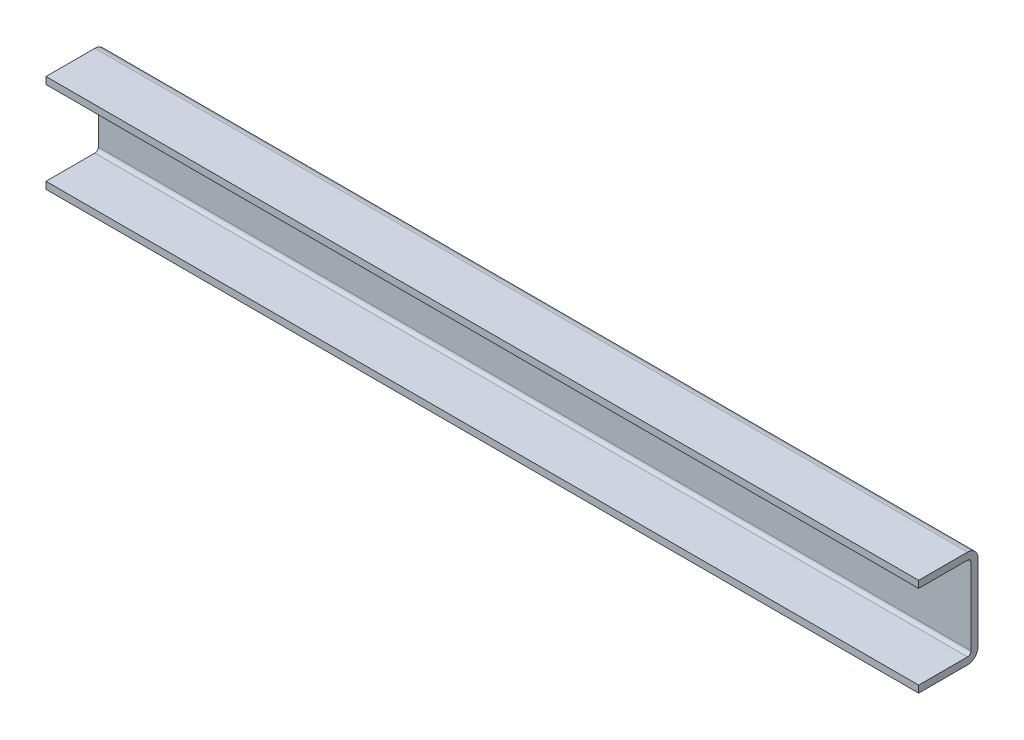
ISO-10303-21;
HEADER;
FILE_DESCRIPTION(('STEP AP214'),'2;1');
FILE_NAME('part.step','',(''),(''),'','','');
FILE_SCHEMA(('AUTOMOTIVE_DESIGN { 1 0 10303 214 1 1 1 1 }'));
ENDSEC;
DATA;
#1=APPLICATION_CONTEXT('core data for automotive mechanical design processes');
#2=APPLICATION_PROTOCOL_DEFINITION('international standard','automotive_design',2000,#1);
#3=PRODUCT_CONTEXT('',#1,'mechanical');
#4=PRODUCT('Part','Part','',(#3));
#5=PRODUCT_RELATED_PRODUCT_CATEGORY('part','',(#4));
#6=PRODUCT_DEFINITION_FORMATION('','',#4);
#7=PRODUCT_DEFINITION_CONTEXT('part definition',#1,'design');
#8=PRODUCT_DEFINITION('design','',#6,#7);
#9=PRODUCT_DEFINITION_SHAPE('','',#8);
#10=(LENGTH_UNIT() NAMED_UNIT(*) SI_UNIT(.MILLI.,.METRE.));
#11=(NAMED_UNIT(*) PLANE_ANGLE_UNIT() SI_UNIT($,.RADIAN.));
#12=(NAMED_UNIT(*) SI_UNIT($,.STERADIAN.) SOLID_ANGLE_UNIT());
#13=UNCERTAINTY_MEASURE_WITH_UNIT(LENGTH_MEASURE(1.E-05),#10,'distance_accuracy_value','');
#14=(GEOMETRIC_REPRESENTATION_CONTEXT(3) GLOBAL_UNCERTAINTY_ASSIGNED_CONTEXT((#13)) GLOBAL_UNIT_ASSIGNED_CONTEXT((#10,
#11,#12)) REPRESENTATION_CONTEXT('',''));
#15=CARTESIAN_POINT('',(0.,0.,0.));
#16=DIRECTION('',(0.,0.,1.));
#17=DIRECTION('',(1.,0.,0.));
#18=AXIS2_PLACEMENT_3D('',#15,#16,#17);
#19=CARTESIAN_POINT('',(-312.5,35.,-35.));
#20=DIRECTION('',(0.,1.,0.));
#21=DIRECTION('',(0.,0.,1.));
#22=AXIS2_PLACEMENT_3D('',#19,#20,#21);
#23=PLANE('',#22);
#24=DIRECTION('',(0.,0.,1.));
#25=VECTOR('',#24,1.);
#26=CARTESIAN_POINT('',(312.5,35.,-35.));
#27=LINE('',#26,#25);
#28=CARTESIAN_POINT('',(312.5,35.,-35.));
#29=VERTEX_POINT('',#28);
#30=CARTESIAN_POINT('',(312.5,35.,0.));
#31=VERTEX_POINT('',#30);
#32=EDGE_CURVE('E156',#29,#31,#27,.T.);
#33=ORIENTED_EDGE('',*,*,#32,.F.);
#34=DIRECTION('',(1.,0.,0.));
#35=VECTOR('',#34,1.);
#36=CARTESIAN_POINT('',(-312.5,35.,-35.));
#37=LINE('',#36,#35);
#38=CARTESIAN_POINT('',(-312.5,35.,-35.));
#39=VERTEX_POINT('',#38);
#40=EDGE_CURVE('E11',#39,#29,#37,.T.);
#41=ORIENTED_EDGE('',*,*,#40,.F.);
#42=DIRECTION('',(0.,0.,1.));
#43=VECTOR('',#42,1.);
#44=CARTESIAN_POINT('',(-312.5,35.,-35.));
#45=LINE('',#44,#43);
#46=CARTESIAN_POINT('',(-312.5,35.,0.));
#47=VERTEX_POINT('',#46);
#48=EDGE_CURVE('E188',#39,#47,#45,.T.);
#49=ORIENTED_EDGE('',*,*,#48,.T.);
#50=DIRECTION('',(1.,0.,0.));
#51=VECTOR('',#50,1.);
#52=CARTESIAN_POINT('',(-312.5,35.,0.));
#53=LINE('',#52,#51);
#54=EDGE_CURVE('E38',#47,#31,#53,.T.);
#55=ORIENTED_EDGE('',*,*,#54,.T.);
#56=EDGE_LOOP('',(#33,#41,#49,#55));
#57=FACE_BOUND('',#56,.T.);
#58=ADVANCED_FACE('F35',(#57),#23,.T.);
#59=CARTESIAN_POINT('',(-312.5,27.5,-35.));
#60=DIRECTION('',(1.,0.,0.));
#61=DIRECTION('',(0.,0.,-1.));
#62=AXIS2_PLACEMENT_3D('',#59,#60,#61);
#63=CYLINDRICAL_SURFACE('',#62,7.5);
#64=CARTESIAN_POINT('',(312.5,27.5,-35.));
#65=DIRECTION('',(1.,0.,0.));
#66=DIRECTION('',(0.,0.,-1.));
#67=AXIS2_PLACEMENT_3D('',#64,#65,#66);
#68=CIRCLE('',#67,7.5);
#69=CARTESIAN_POINT('',(312.5,27.5,-42.5));
#70=VERTEX_POINT('',#69);
#71=EDGE_CURVE('E186',#70,#29,#68,.T.);
#72=ORIENTED_EDGE('',*,*,#71,.F.);
#73=DIRECTION('',(1.,0.,0.));
#74=VECTOR('',#73,1.);
#75=CARTESIAN_POINT('',(-312.5,27.5,-42.5));
#76=LINE('',#75,#74);
#77=CARTESIAN_POINT('',(-312.5,27.5,-42.5));
#78=VERTEX_POINT('',#77);
#79=EDGE_CURVE('E44',#78,#70,#76,.T.);
#80=ORIENTED_EDGE('',*,*,#79,.F.);
#81=CARTESIAN_POINT('',(-312.5,27.5,-35.));
#82=DIRECTION('',(1.,0.,0.));
#83=DIRECTION('',(0.,0.,-1.));
#84=AXIS2_PLACEMENT_3D('',#81,#82,#83);
#85=CIRCLE('',#84,7.5);
#86=EDGE_CURVE('E146',#78,#39,#85,.T.);
#87=ORIENTED_EDGE('',*,*,#86,.T.);
#88=ORIENTED_EDGE('',*,*,#40,.T.);
#89=EDGE_LOOP('',(#72,#80,#87,#88));
#90=FACE_BOUND('',#89,.T.);
#91=ADVANCED_FACE('F208',(#90),#63,.T.);
#92=CARTESIAN_POINT('',(-312.5,-27.5,-42.5));
#93=DIRECTION('',(0.,0.,-1.));
#94=DIRECTION('',(-1.,0.,0.));
#95=AXIS2_PLACEMENT_3D('',#92,#93,#94);
#96=PLANE('',#95);
#97=DIRECTION('',(0.,1.,0.));
#98=VECTOR('',#97,1.);
#99=CARTESIAN_POINT('',(312.5,-27.5,-42.5));
#100=LINE('',#99,#98);
#101=CARTESIAN_POINT('',(312.5,-27.5,-42.5));
#102=VERTEX_POINT('',#101);
#103=EDGE_CURVE('E133',#102,#70,#100,.T.);
#104=ORIENTED_EDGE('',*,*,#103,.F.);
#105=DIRECTION('',(1.,0.,0.));
#106=VECTOR('',#105,1.);
#107=CARTESIAN_POINT('',(-312.5,-27.5,-42.5));
#108=LINE('',#107,#106);
#109=CARTESIAN_POINT('',(-312.5,-27.5,-42.5));
#110=VERTEX_POINT('',#109);
#111=EDGE_CURVE('E128',#110,#102,#108,.T.);
#112=ORIENTED_EDGE('',*,*,#111,.F.);
#113=DIRECTION('',(0.,1.,0.));
#114=VECTOR('',#113,1.);
#115=CARTESIAN_POINT('',(-312.5,-27.5,-42.5));
#116=LINE('',#115,#114);
#117=EDGE_CURVE('E131',#110,#78,#116,.T.);
#118=ORIENTED_EDGE('',*,*,#117,.T.);
#119=ORIENTED_EDGE('',*,*,#79,.T.);
#120=EDGE_LOOP('',(#104,#112,#118,#119));
#121=FACE_BOUND('',#120,.T.);
#122=ADVANCED_FACE('F130',(#121),#96,.T.);
#123=CARTESIAN_POINT('',(-312.5,-27.5,-35.));
#124=DIRECTION('',(1.,0.,0.));
#125=DIRECTION('',(0.,0.,-1.));
#126=AXIS2_PLACEMENT_3D('',#123,#124,#125);
#127=CYLINDRICAL_SURFACE('',#126,7.5);
#128=CARTESIAN_POINT('',(312.5,-27.5,-35.));
#129=DIRECTION('',(1.,0.,0.));
#130=DIRECTION('',(0.,0.,-1.));
#131=AXIS2_PLACEMENT_3D('',#128,#129,#130);
#132=CIRCLE('',#131,7.5);
#133=CARTESIAN_POINT('',(312.5,-35.,-35.));
#134=VERTEX_POINT('',#133);
#135=EDGE_CURVE('E183',#134,#102,#132,.T.);
#136=ORIENTED_EDGE('',*,*,#135,.F.);
#137=DIRECTION('',(1.,0.,0.));
#138=VECTOR('',#137,1.);
#139=CARTESIAN_POINT('',(-312.5,-35.,-35.));
#140=LINE('',#139,#138);
#141=CARTESIAN_POINT('',(-312.5,-35.,-35.));
#142=VERTEX_POINT('',#141);
#143=EDGE_CURVE('E138',#142,#134,#140,.T.);
#144=ORIENTED_EDGE('',*,*,#143,.F.);
#145=CARTESIAN_POINT('',(-312.5,-27.5,-35.));
#146=DIRECTION('',(1.,0.,0.));
#147=DIRECTION('',(0.,0.,-1.));
#148=AXIS2_PLACEMENT_3D('',#145,#146,#147);
#149=CIRCLE('',#148,7.5);
#150=EDGE_CURVE('E144',#142,#110,#149,.T.);
#151=ORIENTED_EDGE('',*,*,#150,.T.);
#152=ORIENTED_EDGE('',*,*,#111,.T.);
#153=EDGE_LOOP('',(#136,#144,#151,#152));
#154=FACE_BOUND('',#153,.T.);
#155=ADVANCED_FACE('F148',(#154),#127,.T.);
#156=CARTESIAN_POINT('',(-312.5,-35.,0.));
#157=DIRECTION('',(0.,-1.,0.));
#158=DIRECTION('',(0.,0.,-1.));
#159=AXIS2_PLACEMENT_3D('',#156,#157,#158);
#160=PLANE('',#159);
#161=DIRECTION('',(0.,0.,-1.));
#162=VECTOR('',#161,1.);
#163=CARTESIAN_POINT('',(312.5,-35.,0.));
#164=LINE('',#163,#162);
#165=CARTESIAN_POINT('',(312.5,-35.,0.));
#166=VERTEX_POINT('',#165);
#167=EDGE_CURVE('E180',#166,#134,#164,.T.);
#168=ORIENTED_EDGE('',*,*,#167,.F.);
#169=DIRECTION('',(1.,0.,0.));
#170=VECTOR('',#169,1.);
#171=CARTESIAN_POINT('',(-312.5,-35.,0.));
#172=LINE('',#171,#170);
#173=CARTESIAN_POINT('',(-312.5,-35.,0.));
#174=VERTEX_POINT('',#173);
#175=EDGE_CURVE('E192',#174,#166,#172,.T.);
#176=ORIENTED_EDGE('',*,*,#175,.F.);
#177=DIRECTION('',(0.,0.,-1.));
#178=VECTOR('',#177,1.);
#179=CARTESIAN_POINT('',(-312.5,-35.,0.));
#180=LINE('',#179,#178);
#181=EDGE_CURVE('E149',#174,#142,#180,.T.);
#182=ORIENTED_EDGE('',*,*,#181,.T.);
#183=ORIENTED_EDGE('',*,*,#143,.T.);
#184=EDGE_LOOP('',(#168,#176,#182,#183));
#185=FACE_BOUND('',#184,.T.);
#186=ADVANCED_FACE('F221',(#185),#160,.T.);
#187=CARTESIAN_POINT('',(-312.5,-30.,0.));
#188=DIRECTION('',(0.,0.,1.));
#189=DIRECTION('',(1.,0.,0.));
#190=AXIS2_PLACEMENT_3D('',#187,#188,#189);
#191=PLANE('',#190);
#192=DIRECTION('',(0.,-1.,0.));
#193=VECTOR('',#192,1.);
#194=CARTESIAN_POINT('',(312.5,-30.,0.));
#195=LINE('',#194,#193);
#196=CARTESIAN_POINT('',(312.5,-30.,0.));
#197=VERTEX_POINT('',#196);
#198=EDGE_CURVE('E177',#197,#166,#195,.T.);
#199=ORIENTED_EDGE('',*,*,#198,.F.);
#200=DIRECTION('',(1.,0.,0.));
#201=VECTOR('',#200,1.);
#202=CARTESIAN_POINT('',(-312.5,-30.,0.));
#203=LINE('',#202,#201);
#204=CARTESIAN_POINT('',(-312.5,-30.,0.));
#205=VERTEX_POINT('',#204);
#206=EDGE_CURVE('E194',#205,#197,#203,.T.);
#207=ORIENTED_EDGE('',*,*,#206,.F.);
#208=DIRECTION('',(0.,-1.,0.));
#209=VECTOR('',#208,1.);
#210=CARTESIAN_POINT('',(-312.5,-30.,0.));
#211=LINE('',#210,#209);
#212=EDGE_CURVE('E151',#205,#174,#211,.T.);
#213=ORIENTED_EDGE('',*,*,#212,.T.);
#214=ORIENTED_EDGE('',*,*,#175,.T.);
#215=EDGE_LOOP('',(#199,#207,#213,#214));
#216=FACE_BOUND('',#215,.T.);
#217=ADVANCED_FACE('F224',(#216),#191,.T.);
#218=CARTESIAN_POINT('',(-312.5,-30.,-35.));
#219=DIRECTION('',(0.,1.,0.));
#220=DIRECTION('',(0.,0.,1.));
#221=AXIS2_PLACEMENT_3D('',#218,#219,#220);
#222=PLANE('',#221);
#223=DIRECTION('',(0.,0.,1.));
#224=VECTOR('',#223,1.);
#225=CARTESIAN_POINT('',(312.5,-30.,-35.));
#226=LINE('',#225,#224);
#227=CARTESIAN_POINT('',(312.5,-30.,-35.));
#228=VERTEX_POINT('',#227);
#229=EDGE_CURVE('E174',#228,#197,#226,.T.);
#230=ORIENTED_EDGE('',*,*,#229,.F.);
#231=DIRECTION('',(1.,0.,0.));
#232=VECTOR('',#231,1.);
#233=CARTESIAN_POINT('',(-312.5,-30.,-35.));
#234=LINE('',#233,#232);
#235=CARTESIAN_POINT('',(-312.5,-30.,-35.));
#236=VERTEX_POINT('',#235);
#237=EDGE_CURVE('E196',#236,#228,#234,.T.);
#238=ORIENTED_EDGE('',*,*,#237,.F.);
#239=DIRECTION('',(0.,0.,1.));
#240=VECTOR('',#239,1.);
#241=CARTESIAN_POINT('',(-312.5,-30.,-35.));
#242=LINE('',#241,#240);
#243=EDGE_CURVE('E350',#236,#205,#242,.T.);
#244=ORIENTED_EDGE('',*,*,#243,.T.);
#245=ORIENTED_EDGE('',*,*,#206,.T.);
#246=EDGE_LOOP('',(#230,#238,#244,#245));
#247=FACE_BOUND('',#246,.T.);
#248=ADVANCED_FACE('F228',(#247),#222,.T.);
#249=CARTESIAN_POINT('',(-312.5,-27.5,-35.));
#250=DIRECTION('',(1.,0.,0.));
#251=DIRECTION('',(0.,0.,-1.));
#252=AXIS2_PLACEMENT_3D('',#249,#250,#251);
#253=CYLINDRICAL_SURFACE('',#252,2.5);
#254=CARTESIAN_POINT('',(312.5,-27.5,-35.));
#255=DIRECTION('',(-1.,0.,0.));
#256=DIRECTION('',(0.,0.,1.));
#257=AXIS2_PLACEMENT_3D('',#254,#255,#256);
#258=CIRCLE('',#257,2.5);
#259=CARTESIAN_POINT('',(312.5,-27.5,-37.5));
#260=VERTEX_POINT('',#259);
#261=EDGE_CURVE('E171',#260,#228,#258,.T.);
#262=ORIENTED_EDGE('',*,*,#261,.F.);
#263=DIRECTION('',(1.,0.,0.));
#264=VECTOR('',#263,1.);
#265=CARTESIAN_POINT('',(-312.5,-27.5,-37.5));
#266=LINE('',#265,#264);
#267=CARTESIAN_POINT('',(-312.5,-27.5,-37.5));
#268=VERTEX_POINT('',#267);
#269=EDGE_CURVE('E198',#268,#260,#266,.T.);
#270=ORIENTED_EDGE('',*,*,#269,.F.);
#271=CARTESIAN_POINT('',(-312.5,-27.5,-35.));
#272=DIRECTION('',(-1.,0.,0.));
#273=DIRECTION('',(0.,0.,1.));
#274=AXIS2_PLACEMENT_3D('',#271,#272,#273);
#275=CIRCLE('',#274,2.5);
#276=EDGE_CURVE('E354',#268,#236,#275,.T.);
#277=ORIENTED_EDGE('',*,*,#276,.T.);
#278=ORIENTED_EDGE('',*,*,#237,.T.);
#279=EDGE_LOOP('',(#262,#270,#277,#278));
#280=FACE_BOUND('',#279,.T.);
#281=ADVANCED_FACE('F232',(#280),#253,.F.);
#282=CARTESIAN_POINT('',(-312.5,27.5,-37.5));
#283=DIRECTION('',(0.,0.,1.));
#284=DIRECTION('',(0.,-1.,0.));
#285=AXIS2_PLACEMENT_3D('',#282,#283,#284);
#286=PLANE('',#285);
#287=DIRECTION('',(0.,-1.,0.));
#288=VECTOR('',#287,1.);
#289=CARTESIAN_POINT('',(312.5,27.5,-37.5));
#290=LINE('',#289,#288);
#291=CARTESIAN_POINT('',(312.5,27.5,-37.5));
#292=VERTEX_POINT('',#291);
#293=EDGE_CURVE('E168',#292,#260,#290,.T.);
#294=ORIENTED_EDGE('',*,*,#293,.F.);
#295=DIRECTION('',(1.,0.,0.));
#296=VECTOR('',#295,1.);
#297=CARTESIAN_POINT('',(-312.5,27.5,-37.5));
#298=LINE('',#297,#296);
#299=CARTESIAN_POINT('',(-312.5,27.5,-37.5));
#300=VERTEX_POINT('',#299);
#301=EDGE_CURVE('E200',#300,#292,#298,.T.);
#302=ORIENTED_EDGE('',*,*,#301,.F.);
#303=DIRECTION('',(0.,-1.,0.));
#304=VECTOR('',#303,1.);
#305=CARTESIAN_POINT('',(-312.5,27.5,-37.5));
#306=LINE('',#305,#304);
#307=EDGE_CURVE('E343',#300,#268,#306,.T.);
#308=ORIENTED_EDGE('',*,*,#307,.T.);
#309=ORIENTED_EDGE('',*,*,#269,.T.);
#310=EDGE_LOOP('',(#294,#302,#308,#309));
#311=FACE_BOUND('',#310,.T.);
#312=ADVANCED_FACE('F236',(#311),#286,.T.);
#313=CARTESIAN_POINT('',(-312.5,27.5,-35.));
#314=DIRECTION('',(1.,0.,0.));
#315=DIRECTION('',(0.,0.,-1.));
#316=AXIS2_PLACEMENT_3D('',#313,#314,#315);
#317=CYLINDRICAL_SURFACE('',#316,2.5);
#318=CARTESIAN_POINT('',(312.5,27.5,-35.));
#319=DIRECTION('',(-1.,0.,0.));
#320=DIRECTION('',(0.,0.,1.));
#321=AXIS2_PLACEMENT_3D('',#318,#319,#320);
#322=CIRCLE('',#321,2.5);
#323=CARTESIAN_POINT('',(312.5,30.,-35.));
#324=VERTEX_POINT('',#323);
#325=EDGE_CURVE('E165',#324,#292,#322,.T.);
#326=ORIENTED_EDGE('',*,*,#325,.F.);
#327=DIRECTION('',(1.,0.,0.));
#328=VECTOR('',#327,1.);
#329=CARTESIAN_POINT('',(-312.5,30.,-35.));
#330=LINE('',#329,#328);
#331=CARTESIAN_POINT('',(-312.5,30.,-35.));
#332=VERTEX_POINT('',#331);
#333=EDGE_CURVE('E202',#332,#324,#330,.T.);
#334=ORIENTED_EDGE('',*,*,#333,.F.);
#335=CARTESIAN_POINT('',(-312.5,27.5,-35.));
#336=DIRECTION('',(-1.,0.,0.));
#337=DIRECTION('',(0.,0.,1.));
#338=AXIS2_PLACEMENT_3D('',#335,#336,#337);
#339=CIRCLE('',#338,2.5);
#340=EDGE_CURVE('E339',#332,#300,#339,.T.);
#341=ORIENTED_EDGE('',*,*,#340,.T.);
#342=ORIENTED_EDGE('',*,*,#301,.T.);
#343=EDGE_LOOP('',(#326,#334,#341,#342));
#344=FACE_BOUND('',#343,.T.);
#345=ADVANCED_FACE('F240',(#344),#317,.F.);
#346=CARTESIAN_POINT('',(-312.5,30.,0.));
#347=DIRECTION('',(0.,-1.,0.));
#348=DIRECTION('',(0.,0.,-1.));
#349=AXIS2_PLACEMENT_3D('',#346,#347,#348);
#350=PLANE('',#349);
#351=DIRECTION('',(0.,0.,-1.));
#352=VECTOR('',#351,1.);
#353=CARTESIAN_POINT('',(312.5,30.,0.));
#354=LINE('',#353,#352);
#355=CARTESIAN_POINT('',(312.5,30.,0.));
#356=VERTEX_POINT('',#355);
#357=EDGE_CURVE('E162',#356,#324,#354,.T.);
#358=ORIENTED_EDGE('',*,*,#357,.F.);
#359=DIRECTION('',(1.,0.,0.));
#360=VECTOR('',#359,1.);
#361=CARTESIAN_POINT('',(-312.5,30.,0.));
#362=LINE('',#361,#360);
#363=CARTESIAN_POINT('',(-312.5,30.,0.));
#364=VERTEX_POINT('',#363);
#365=EDGE_CURVE('E203',#364,#356,#362,.T.);
#366=ORIENTED_EDGE('',*,*,#365,.F.);
#367=DIRECTION('',(0.,0.,-1.));
#368=VECTOR('',#367,1.);
#369=CARTESIAN_POINT('',(-312.5,30.,0.));
#370=LINE('',#369,#368);
#371=EDGE_CURVE('E360',#364,#332,#370,.T.);
#372=ORIENTED_EDGE('',*,*,#371,.T.);
#373=ORIENTED_EDGE('',*,*,#333,.T.);
#374=EDGE_LOOP('',(#358,#366,#372,#373));
#375=FACE_BOUND('',#374,.T.);
#376=ADVANCED_FACE('F244',(#375),#350,.T.);
#377=CARTESIAN_POINT('',(-312.5,35.,0.));
#378=DIRECTION('',(0.,0.,1.));
#379=DIRECTION('',(1.,0.,0.));
#380=AXIS2_PLACEMENT_3D('',#377,#378,#379);
#381=PLANE('',#380);
#382=DIRECTION('',(0.,-1.,0.));
#383=VECTOR('',#382,1.);
#384=CARTESIAN_POINT('',(312.5,35.,0.));
#385=LINE('',#384,#383);
#386=EDGE_CURVE('E159',#31,#356,#385,.T.);
#387=ORIENTED_EDGE('',*,*,#386,.F.);
#388=ORIENTED_EDGE('',*,*,#54,.F.);
#389=DIRECTION('',(0.,-1.,0.));
#390=VECTOR('',#389,1.);
#391=CARTESIAN_POINT('',(-312.5,35.,0.));
#392=LINE('',#391,#390);
#393=EDGE_CURVE('E362',#47,#364,#392,.T.);
#394=ORIENTED_EDGE('',*,*,#393,.T.);
#395=ORIENTED_EDGE('',*,*,#365,.T.);
#396=EDGE_LOOP('',(#387,#388,#394,#395));
#397=FACE_BOUND('',#396,.T.);
#398=ADVANCED_FACE('F205',(#397),#381,.T.);
#399=CARTESIAN_POINT('',(-312.5,27.5,-35.));
#400=DIRECTION('',(-1.,0.,0.));
#401=DIRECTION('',(0.,0.,1.));
#402=AXIS2_PLACEMENT_3D('',#399,#400,#401);
#403=PLANE('',#402);
#404=ORIENTED_EDGE('',*,*,#48,.F.);
#405=ORIENTED_EDGE('',*,*,#86,.F.);
#406=ORIENTED_EDGE('',*,*,#117,.F.);
#407=ORIENTED_EDGE('',*,*,#150,.F.);
#408=ORIENTED_EDGE('',*,*,#181,.F.);
#409=ORIENTED_EDGE('',*,*,#212,.F.);
#410=ORIENTED_EDGE('',*,*,#243,.F.);
#411=ORIENTED_EDGE('',*,*,#276,.F.);
#412=ORIENTED_EDGE('',*,*,#307,.F.);
#413=ORIENTED_EDGE('',*,*,#340,.F.);
#414=ORIENTED_EDGE('',*,*,#371,.F.);
#415=ORIENTED_EDGE('',*,*,#393,.F.);
#416=EDGE_LOOP('',(#404,#405,#406,#407,#408,#409,#410,#411,#412,#413,#414,#415));
#417=FACE_BOUND('',#416,.T.);
#418=ADVANCED_FACE('F142',(#417),#403,.T.);
#419=CARTESIAN_POINT('',(312.5,27.5,-35.));
#420=DIRECTION('',(-1.,0.,0.));
#421=DIRECTION('',(0.,0.,1.));
#422=AXIS2_PLACEMENT_3D('',#419,#420,#421);
#423=PLANE('',#422);
#424=ORIENTED_EDGE('',*,*,#32,.T.);
#425=ORIENTED_EDGE('',*,*,#386,.T.);
#426=ORIENTED_EDGE('',*,*,#357,.T.);
#427=ORIENTED_EDGE('',*,*,#325,.T.);
#428=ORIENTED_EDGE('',*,*,#293,.T.);
#429=ORIENTED_EDGE('',*,*,#261,.T.);
#430=ORIENTED_EDGE('',*,*,#229,.T.);
#431=ORIENTED_EDGE('',*,*,#198,.T.);
#432=ORIENTED_EDGE('',*,*,#167,.T.);
#433=ORIENTED_EDGE('',*,*,#135,.T.);
#434=ORIENTED_EDGE('',*,*,#103,.T.);
#435=ORIENTED_EDGE('',*,*,#71,.T.);
#436=EDGE_LOOP('',(#424,#425,#426,#427,#428,#429,#430,#431,#432,#433,#434,#435));
#437=FACE_BOUND('',#436,.T.);
#438=ADVANCED_FACE('F207',(#437),#423,.F.);
#439=CLOSED_SHELL('',(#58,#91,#122,#155,#186,#217,#248,#281,#312,#345,#376,#398,#418,#438));
#440=MANIFOLD_SOLID_BREP('B2',#439);
#441=ADVANCED_BREP_SHAPE_REPRESENTATION('',(#18,#440),#14);
#442=SHAPE_DEFINITION_REPRESENTATION(#9,#441);
ENDSEC;
END-ISO-10303-21;
